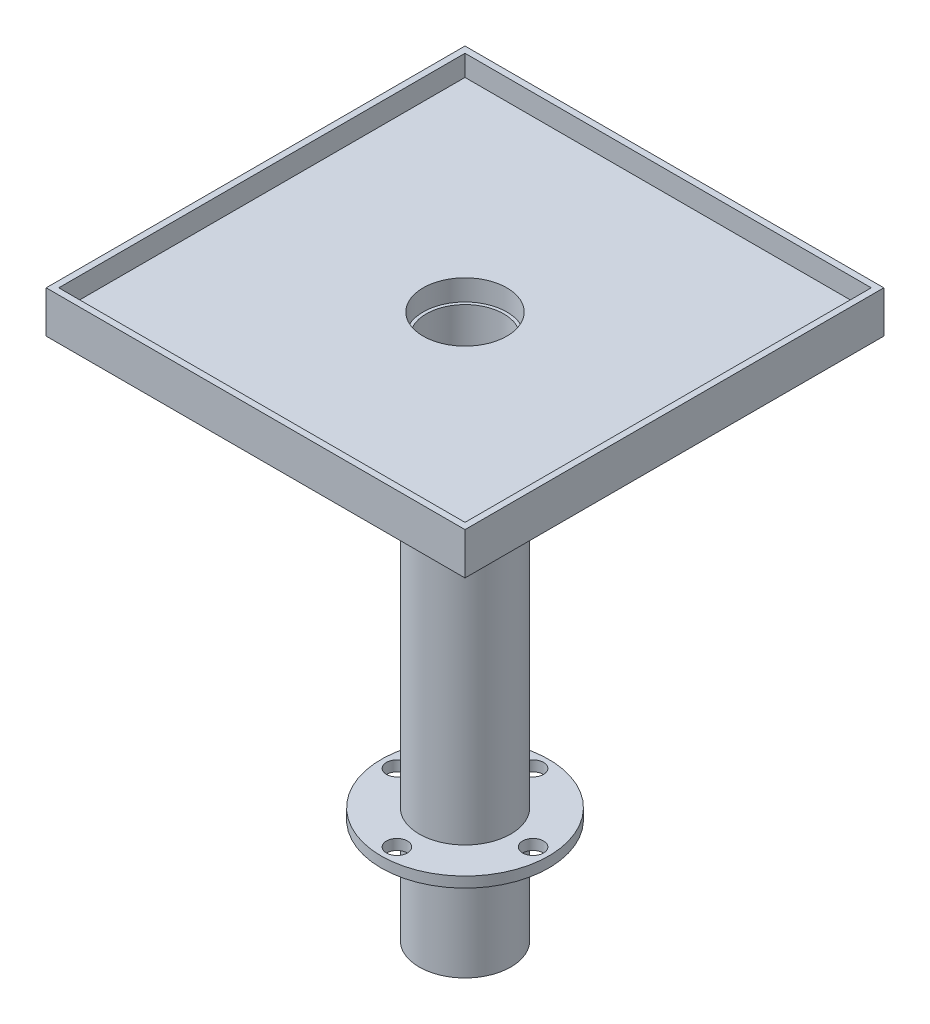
ISO-10303-21;
HEADER;
FILE_DESCRIPTION(('STEP AP214'),'2;1');
FILE_NAME('part.step','',(''),(''),'','','');
FILE_SCHEMA(('AUTOMOTIVE_DESIGN { 1 0 10303 214 1 1 1 1 }'));
ENDSEC;
DATA;
#1=APPLICATION_CONTEXT('core data for automotive mechanical design processes');
#2=APPLICATION_PROTOCOL_DEFINITION('international standard','automotive_design',2000,#1);
#3=PRODUCT_CONTEXT('',#1,'mechanical');
#4=PRODUCT('Part','Part','',(#3));
#5=PRODUCT_RELATED_PRODUCT_CATEGORY('part','',(#4));
#6=PRODUCT_DEFINITION_FORMATION('','',#4);
#7=PRODUCT_DEFINITION_CONTEXT('part definition',#1,'design');
#8=PRODUCT_DEFINITION('design','',#6,#7);
#9=PRODUCT_DEFINITION_SHAPE('','',#8);
#10=(LENGTH_UNIT() NAMED_UNIT(*) SI_UNIT(.MILLI.,.METRE.));
#11=(NAMED_UNIT(*) PLANE_ANGLE_UNIT() SI_UNIT($,.RADIAN.));
#12=(NAMED_UNIT(*) SI_UNIT($,.STERADIAN.) SOLID_ANGLE_UNIT());
#13=UNCERTAINTY_MEASURE_WITH_UNIT(LENGTH_MEASURE(1.E-05),#10,'distance_accuracy_value','');
#14=(GEOMETRIC_REPRESENTATION_CONTEXT(3) GLOBAL_UNCERTAINTY_ASSIGNED_CONTEXT((#13)) GLOBAL_UNIT_ASSIGNED_CONTEXT((#10,
#11,#12)) REPRESENTATION_CONTEXT('',''));
#15=CARTESIAN_POINT('',(0.,0.,0.));
#16=DIRECTION('',(0.,0.,1.));
#17=DIRECTION('',(1.,0.,0.));
#18=AXIS2_PLACEMENT_3D('',#15,#16,#17);
#19=CARTESIAN_POINT('',(0.,53.34,0.));
#20=DIRECTION('',(0.,1.,0.));
#21=DIRECTION('',(0.,0.,1.));
#22=AXIS2_PLACEMENT_3D('',#19,#20,#21);
#23=PLANE('',#22);
#24=CARTESIAN_POINT('',(0.,53.34,0.));
#25=DIRECTION('',(0.,1.,0.));
#26=DIRECTION('',(0.,0.,1.));
#27=AXIS2_PLACEMENT_3D('',#24,#25,#26);
#28=CIRCLE('',#27,5.08);
#29=CARTESIAN_POINT('',(0.,53.34,5.08));
#30=VERTEX_POINT('',#29);
#31=EDGE_CURVE('E195',#30,#30,#28,.T.);
#32=ORIENTED_EDGE('',*,*,#31,.F.);
#33=EDGE_LOOP('',(#32));
#34=FACE_BOUND('',#33,.T.);
#35=DIRECTION('',(0.,0.,1.));
#36=VECTOR('',#35,1.);
#37=CARTESIAN_POINT('',(24.638,53.34,0.));
#38=LINE('',#37,#36);
#39=CARTESIAN_POINT('',(24.638,53.34,-24.638));
#40=VERTEX_POINT('',#39);
#41=CARTESIAN_POINT('',(24.638,53.34,24.638));
#42=VERTEX_POINT('',#41);
#43=EDGE_CURVE('E65',#40,#42,#38,.T.);
#44=ORIENTED_EDGE('',*,*,#43,.F.);
#45=DIRECTION('',(1.,0.,0.));
#46=VECTOR('',#45,1.);
#47=CARTESIAN_POINT('',(0.,53.34,-24.638));
#48=LINE('',#47,#46);
#49=CARTESIAN_POINT('',(-24.638,53.34,-24.638));
#50=VERTEX_POINT('',#49);
#51=EDGE_CURVE('E173',#50,#40,#48,.T.);
#52=ORIENTED_EDGE('',*,*,#51,.F.);
#53=DIRECTION('',(0.,0.,1.));
#54=VECTOR('',#53,1.);
#55=CARTESIAN_POINT('',(-24.638,53.34,0.));
#56=LINE('',#55,#54);
#57=CARTESIAN_POINT('',(-24.638,53.34,24.638));
#58=VERTEX_POINT('',#57);
#59=EDGE_CURVE('E145',#50,#58,#56,.T.);
#60=ORIENTED_EDGE('',*,*,#59,.T.);
#61=DIRECTION('',(1.,0.,0.));
#62=VECTOR('',#61,1.);
#63=CARTESIAN_POINT('',(0.,53.34,24.638));
#64=LINE('',#63,#62);
#65=EDGE_CURVE('E70',#58,#42,#64,.T.);
#66=ORIENTED_EDGE('',*,*,#65,.T.);
#67=EDGE_LOOP('',(#44,#52,#60,#66));
#68=FACE_BOUND('',#67,.T.);
#69=ADVANCED_FACE('F47',(#34,#68),#23,.T.);
#70=CARTESIAN_POINT('',(0.,50.8,0.));
#71=DIRECTION('',(0.,1.,0.));
#72=DIRECTION('',(0.,0.,1.));
#73=AXIS2_PLACEMENT_3D('',#70,#71,#72);
#74=PLANE('',#73);
#75=CARTESIAN_POINT('',(0.,50.8,0.));
#76=DIRECTION('',(0.,1.,0.));
#77=DIRECTION('',(0.,0.,1.));
#78=AXIS2_PLACEMENT_3D('',#75,#76,#77);
#79=CIRCLE('',#78,4.699);
#80=CARTESIAN_POINT('',(0.,50.8,4.699));
#81=VERTEX_POINT('',#80);
#82=EDGE_CURVE('E221',#81,#81,#79,.T.);
#83=ORIENTED_EDGE('',*,*,#82,.F.);
#84=EDGE_LOOP('',(#83));
#85=FACE_BOUND('',#84,.T.);
#86=CARTESIAN_POINT('',(0.,50.8,0.));
#87=DIRECTION('',(0.,1.,0.));
#88=DIRECTION('',(0.,0.,1.));
#89=AXIS2_PLACEMENT_3D('',#86,#87,#88);
#90=CIRCLE('',#89,5.08);
#91=CARTESIAN_POINT('',(0.,50.8,5.08));
#92=VERTEX_POINT('',#91);
#93=EDGE_CURVE('E194',#92,#92,#90,.T.);
#94=ORIENTED_EDGE('',*,*,#93,.T.);
#95=EDGE_LOOP('',(#94));
#96=FACE_BOUND('',#95,.T.);
#97=ADVANCED_FACE('F280',(#85,#96),#74,.T.);
#98=CARTESIAN_POINT('',(0.,-12.7,0.));
#99=DIRECTION('',(0.,1.,0.));
#100=DIRECTION('',(0.,0.,1.));
#101=AXIS2_PLACEMENT_3D('',#98,#99,#100);
#102=CYLINDRICAL_SURFACE('',#101,5.55173289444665);
#103=CARTESIAN_POINT('',(0.,-12.7,0.));
#104=DIRECTION('',(0.,1.,0.));
#105=DIRECTION('',(0.,0.,1.));
#106=AXIS2_PLACEMENT_3D('',#103,#104,#105);
#107=CIRCLE('',#106,5.55173289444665);
#108=CARTESIAN_POINT('',(0.,-12.7,5.55173289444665));
#109=VERTEX_POINT('',#108);
#110=EDGE_CURVE('E233',#109,#109,#107,.T.);
#111=ORIENTED_EDGE('',*,*,#110,.T.);
#112=EDGE_LOOP('',(#111));
#113=FACE_BOUND('',#112,.T.);
#114=CARTESIAN_POINT('',(0.,0.,0.));
#115=DIRECTION('',(0.,1.,0.));
#116=DIRECTION('',(0.,0.,1.));
#117=AXIS2_PLACEMENT_3D('',#114,#115,#116);
#118=CIRCLE('',#117,5.55173289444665);
#119=CARTESIAN_POINT('',(0.,0.,5.55173289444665));
#120=VERTEX_POINT('',#119);
#121=EDGE_CURVE('E236',#120,#120,#118,.T.);
#122=ORIENTED_EDGE('',*,*,#121,.F.);
#123=EDGE_LOOP('',(#122));
#124=FACE_BOUND('',#123,.T.);
#125=ADVANCED_FACE('F288',(#113,#124),#102,.T.);
#126=CARTESIAN_POINT('',(0.,1.27,0.));
#127=DIRECTION('',(0.,1.,0.));
#128=DIRECTION('',(0.,0.,1.));
#129=AXIS2_PLACEMENT_3D('',#126,#127,#128);
#130=CIRCLE('',#129,5.55173289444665);
#131=CARTESIAN_POINT('',(0.,1.27,5.55173289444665));
#132=VERTEX_POINT('',#131);
#133=EDGE_CURVE('E11',#132,#132,#130,.T.);
#134=ORIENTED_EDGE('',*,*,#133,.T.);
#135=EDGE_LOOP('',(#134));
#136=FACE_BOUND('',#135,.T.);
#137=CARTESIAN_POINT('',(0.,50.8,0.));
#138=DIRECTION('',(0.,1.,0.));
#139=DIRECTION('',(0.,0.,1.));
#140=AXIS2_PLACEMENT_3D('',#137,#138,#139);
#141=CIRCLE('',#140,5.55173289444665);
#142=CARTESIAN_POINT('',(0.,50.8,5.55173289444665));
#143=VERTEX_POINT('',#142);
#144=EDGE_CURVE('E225',#143,#143,#141,.T.);
#145=ORIENTED_EDGE('',*,*,#144,.F.);
#146=EDGE_LOOP('',(#145));
#147=FACE_BOUND('',#146,.T.);
#148=ADVANCED_FACE('F319',(#136,#147),#102,.T.);
#149=CARTESIAN_POINT('',(0.,-12.7,0.));
#150=DIRECTION('',(0.,1.,0.));
#151=DIRECTION('',(0.,0.,1.));
#152=AXIS2_PLACEMENT_3D('',#149,#150,#151);
#153=PLANE('',#152);
#154=CARTESIAN_POINT('',(0.,-12.7,0.));
#155=DIRECTION('',(0.,1.,0.));
#156=DIRECTION('',(0.,0.,1.));
#157=AXIS2_PLACEMENT_3D('',#154,#155,#156);
#158=CIRCLE('',#157,4.699);
#159=CARTESIAN_POINT('',(0.,-12.7,4.699));
#160=VERTEX_POINT('',#159);
#161=EDGE_CURVE('E229',#160,#160,#158,.T.);
#162=ORIENTED_EDGE('',*,*,#161,.T.);
#163=EDGE_LOOP('',(#162));
#164=FACE_BOUND('',#163,.T.);
#165=ORIENTED_EDGE('',*,*,#110,.F.);
#166=EDGE_LOOP('',(#165));
#167=FACE_BOUND('',#166,.T.);
#168=ADVANCED_FACE('F315',(#164,#167),#153,.F.);
#169=CARTESIAN_POINT('',(0.,-12.7,0.));
#170=DIRECTION('',(0.,1.,0.));
#171=DIRECTION('',(0.,0.,1.));
#172=AXIS2_PLACEMENT_3D('',#169,#170,#171);
#173=CYLINDRICAL_SURFACE('',#172,4.699);
#174=ORIENTED_EDGE('',*,*,#161,.F.);
#175=EDGE_LOOP('',(#174));
#176=FACE_BOUND('',#175,.T.);
#177=ORIENTED_EDGE('',*,*,#82,.T.);
#178=EDGE_LOOP('',(#177));
#179=FACE_BOUND('',#178,.T.);
#180=ADVANCED_FACE('F311',(#176,#179),#173,.F.);
#181=CARTESIAN_POINT('',(0.,1.27,0.));
#182=DIRECTION('',(0.,1.,0.));
#183=DIRECTION('',(0.,0.,1.));
#184=AXIS2_PLACEMENT_3D('',#181,#182,#183);
#185=PLANE('',#184);
#186=CARTESIAN_POINT('',(0.,1.27,-8.255));
#187=DIRECTION('',(0.,1.,0.));
#188=DIRECTION('',(0.,0.,1.));
#189=AXIS2_PLACEMENT_3D('',#186,#187,#188);
#190=CIRCLE('',#189,1.27);
#191=CARTESIAN_POINT('',(0.,1.27,-6.985));
#192=VERTEX_POINT('',#191);
#193=EDGE_CURVE('E253',#192,#192,#190,.T.);
#194=ORIENTED_EDGE('',*,*,#193,.F.);
#195=EDGE_LOOP('',(#194));
#196=FACE_BOUND('',#195,.T.);
#197=CARTESIAN_POINT('',(0.,1.27,8.255));
#198=DIRECTION('',(0.,1.,0.));
#199=DIRECTION('',(0.,0.,1.));
#200=AXIS2_PLACEMENT_3D('',#197,#198,#199);
#201=CIRCLE('',#200,1.27);
#202=CARTESIAN_POINT('',(0.,1.27,9.525));
#203=VERTEX_POINT('',#202);
#204=EDGE_CURVE('E517',#203,#203,#201,.T.);
#205=ORIENTED_EDGE('',*,*,#204,.F.);
#206=EDGE_LOOP('',(#205));
#207=FACE_BOUND('',#206,.T.);
#208=CARTESIAN_POINT('',(8.255,1.27,0.));
#209=DIRECTION('',(0.,1.,0.));
#210=DIRECTION('',(0.,0.,1.));
#211=AXIS2_PLACEMENT_3D('',#208,#209,#210);
#212=CIRCLE('',#211,1.27);
#213=CARTESIAN_POINT('',(8.255,1.27,1.27));
#214=VERTEX_POINT('',#213);
#215=EDGE_CURVE('E506',#214,#214,#212,.T.);
#216=ORIENTED_EDGE('',*,*,#215,.F.);
#217=EDGE_LOOP('',(#216));
#218=FACE_BOUND('',#217,.T.);
#219=CARTESIAN_POINT('',(-8.255,1.27,0.));
#220=DIRECTION('',(0.,1.,0.));
#221=DIRECTION('',(0.,0.,1.));
#222=AXIS2_PLACEMENT_3D('',#219,#220,#221);
#223=CIRCLE('',#222,1.27);
#224=CARTESIAN_POINT('',(-8.255,1.27,1.27));
#225=VERTEX_POINT('',#224);
#226=EDGE_CURVE('E150',#225,#225,#223,.T.);
#227=ORIENTED_EDGE('',*,*,#226,.F.);
#228=EDGE_LOOP('',(#227));
#229=FACE_BOUND('',#228,.T.);
#230=ORIENTED_EDGE('',*,*,#133,.F.);
#231=EDGE_LOOP('',(#230));
#232=FACE_BOUND('',#231,.T.);
#233=CARTESIAN_POINT('',(0.,1.27,0.));
#234=DIRECTION('',(0.,1.,0.));
#235=DIRECTION('',(0.,0.,1.));
#236=AXIS2_PLACEMENT_3D('',#233,#234,#235);
#237=CIRCLE('',#236,10.16);
#238=CARTESIAN_POINT('',(0.,1.27,10.16));
#239=VERTEX_POINT('',#238);
#240=EDGE_CURVE('E57',#239,#239,#237,.T.);
#241=ORIENTED_EDGE('',*,*,#240,.T.);
#242=EDGE_LOOP('',(#241));
#243=FACE_BOUND('',#242,.T.);
#244=ADVANCED_FACE('F314',(#196,#207,#218,#229,#232,#243),#185,.T.);
#245=CARTESIAN_POINT('',(0.,0.,0.));
#246=DIRECTION('',(0.,1.,0.));
#247=DIRECTION('',(0.,0.,1.));
#248=AXIS2_PLACEMENT_3D('',#245,#246,#247);
#249=PLANE('',#248);
#250=CARTESIAN_POINT('',(0.,0.,-8.255));
#251=DIRECTION('',(0.,1.,0.));
#252=DIRECTION('',(0.,0.,1.));
#253=AXIS2_PLACEMENT_3D('',#250,#251,#252);
#254=CIRCLE('',#253,1.27);
#255=CARTESIAN_POINT('',(0.,0.,-6.985));
#256=VERTEX_POINT('',#255);
#257=EDGE_CURVE('E51',#256,#256,#254,.T.);
#258=ORIENTED_EDGE('',*,*,#257,.T.);
#259=EDGE_LOOP('',(#258));
#260=FACE_BOUND('',#259,.T.);
#261=CARTESIAN_POINT('',(0.,0.,8.255));
#262=DIRECTION('',(0.,1.,0.));
#263=DIRECTION('',(0.,0.,1.));
#264=AXIS2_PLACEMENT_3D('',#261,#262,#263);
#265=CIRCLE('',#264,1.27);
#266=CARTESIAN_POINT('',(0.,0.,9.525));
#267=VERTEX_POINT('',#266);
#268=EDGE_CURVE('E256',#267,#267,#265,.T.);
#269=ORIENTED_EDGE('',*,*,#268,.T.);
#270=EDGE_LOOP('',(#269));
#271=FACE_BOUND('',#270,.T.);
#272=CARTESIAN_POINT('',(8.255,0.,0.));
#273=DIRECTION('',(0.,1.,0.));
#274=DIRECTION('',(0.,0.,1.));
#275=AXIS2_PLACEMENT_3D('',#272,#273,#274);
#276=CIRCLE('',#275,1.27);
#277=CARTESIAN_POINT('',(8.255,0.,1.27));
#278=VERTEX_POINT('',#277);
#279=EDGE_CURVE('E252',#278,#278,#276,.T.);
#280=ORIENTED_EDGE('',*,*,#279,.T.);
#281=EDGE_LOOP('',(#280));
#282=FACE_BOUND('',#281,.T.);
#283=CARTESIAN_POINT('',(-8.255,0.,0.));
#284=DIRECTION('',(0.,1.,0.));
#285=DIRECTION('',(0.,0.,1.));
#286=AXIS2_PLACEMENT_3D('',#283,#284,#285);
#287=CIRCLE('',#286,1.27);
#288=CARTESIAN_POINT('',(-8.255,0.,1.27));
#289=VERTEX_POINT('',#288);
#290=EDGE_CURVE('E248',#289,#289,#287,.T.);
#291=ORIENTED_EDGE('',*,*,#290,.T.);
#292=EDGE_LOOP('',(#291));
#293=FACE_BOUND('',#292,.T.);
#294=ORIENTED_EDGE('',*,*,#121,.T.);
#295=EDGE_LOOP('',(#294));
#296=FACE_BOUND('',#295,.T.);
#297=CARTESIAN_POINT('',(0.,0.,0.));
#298=DIRECTION('',(0.,1.,0.));
#299=DIRECTION('',(0.,0.,1.));
#300=AXIS2_PLACEMENT_3D('',#297,#298,#299);
#301=CIRCLE('',#300,10.16);
#302=CARTESIAN_POINT('',(0.,0.,10.16));
#303=VERTEX_POINT('',#302);
#304=EDGE_CURVE('E241',#303,#303,#301,.T.);
#305=ORIENTED_EDGE('',*,*,#304,.F.);
#306=EDGE_LOOP('',(#305));
#307=FACE_BOUND('',#306,.T.);
#308=ADVANCED_FACE('F265',(#260,#271,#282,#293,#296,#307),#249,.F.);
#309=CARTESIAN_POINT('',(0.,1.27,0.));
#310=DIRECTION('',(0.,-1.,0.));
#311=DIRECTION('',(0.,0.,-1.));
#312=AXIS2_PLACEMENT_3D('',#309,#310,#311);
#313=CYLINDRICAL_SURFACE('',#312,10.16);
#314=ORIENTED_EDGE('',*,*,#240,.F.);
#315=EDGE_LOOP('',(#314));
#316=FACE_BOUND('',#315,.T.);
#317=ORIENTED_EDGE('',*,*,#304,.T.);
#318=EDGE_LOOP('',(#317));
#319=FACE_BOUND('',#318,.T.);
#320=ADVANCED_FACE('F49',(#316,#319),#313,.T.);
#321=CARTESIAN_POINT('',(0.,50.8,0.));
#322=DIRECTION('',(0.,1.,0.));
#323=DIRECTION('',(0.,0.,1.));
#324=AXIS2_PLACEMENT_3D('',#321,#322,#323);
#325=PLANE('',#324);
#326=DIRECTION('',(0.,0.,1.));
#327=VECTOR('',#326,1.);
#328=CARTESIAN_POINT('',(-25.4,50.8,-25.4));
#329=LINE('',#328,#327);
#330=CARTESIAN_POINT('',(-25.4,50.8,-25.4));
#331=VERTEX_POINT('',#330);
#332=CARTESIAN_POINT('',(-25.4,50.8,25.4));
#333=VERTEX_POINT('',#332);
#334=EDGE_CURVE('E199',#331,#333,#329,.T.);
#335=ORIENTED_EDGE('',*,*,#334,.F.);
#336=DIRECTION('',(-1.,0.,0.));
#337=VECTOR('',#336,1.);
#338=CARTESIAN_POINT('',(-25.4,50.8,-25.4));
#339=LINE('',#338,#337);
#340=CARTESIAN_POINT('',(25.4,50.8,-25.4));
#341=VERTEX_POINT('',#340);
#342=EDGE_CURVE('E121',#341,#331,#339,.T.);
#343=ORIENTED_EDGE('',*,*,#342,.F.);
#344=DIRECTION('',(0.,0.,-1.));
#345=VECTOR('',#344,1.);
#346=CARTESIAN_POINT('',(25.4,50.8,-25.4));
#347=LINE('',#346,#345);
#348=CARTESIAN_POINT('',(25.4,50.8,25.4));
#349=VERTEX_POINT('',#348);
#350=EDGE_CURVE('E208',#349,#341,#347,.T.);
#351=ORIENTED_EDGE('',*,*,#350,.F.);
#352=DIRECTION('',(1.,0.,0.));
#353=VECTOR('',#352,1.);
#354=CARTESIAN_POINT('',(-25.4,50.8,25.4));
#355=LINE('',#354,#353);
#356=EDGE_CURVE('E205',#333,#349,#355,.T.);
#357=ORIENTED_EDGE('',*,*,#356,.F.);
#358=EDGE_LOOP('',(#335,#343,#351,#357));
#359=FACE_BOUND('',#358,.T.);
#360=ORIENTED_EDGE('',*,*,#144,.T.);
#361=EDGE_LOOP('',(#360));
#362=FACE_BOUND('',#361,.T.);
#363=ADVANCED_FACE('F296',(#359,#362),#325,.F.);
#364=CARTESIAN_POINT('',(-25.4,53.34,-25.4));
#365=DIRECTION('',(1.,0.,0.));
#366=DIRECTION('',(0.,0.,-1.));
#367=AXIS2_PLACEMENT_3D('',#364,#365,#366);
#368=PLANE('',#367);
#369=ORIENTED_EDGE('',*,*,#334,.T.);
#370=DIRECTION('',(0.,-1.,0.));
#371=VECTOR('',#370,1.);
#372=CARTESIAN_POINT('',(-25.4,53.34,25.4));
#373=LINE('',#372,#371);
#374=CARTESIAN_POINT('',(-25.4,55.88,25.4));
#375=VERTEX_POINT('',#374);
#376=EDGE_CURVE('E132',#375,#333,#373,.T.);
#377=ORIENTED_EDGE('',*,*,#376,.F.);
#378=DIRECTION('',(0.,0.,1.));
#379=VECTOR('',#378,1.);
#380=CARTESIAN_POINT('',(-25.4,55.88,0.));
#381=LINE('',#380,#379);
#382=CARTESIAN_POINT('',(-25.4,55.88,-25.4));
#383=VERTEX_POINT('',#382);
#384=EDGE_CURVE('E129',#383,#375,#381,.T.);
#385=ORIENTED_EDGE('',*,*,#384,.F.);
#386=DIRECTION('',(0.,-1.,0.));
#387=VECTOR('',#386,1.);
#388=CARTESIAN_POINT('',(-25.4,53.34,-25.4));
#389=LINE('',#388,#387);
#390=EDGE_CURVE('E114',#383,#331,#389,.T.);
#391=ORIENTED_EDGE('',*,*,#390,.T.);
#392=EDGE_LOOP('',(#369,#377,#385,#391));
#393=FACE_BOUND('',#392,.T.);
#394=ADVANCED_FACE('F130',(#393),#368,.F.);
#395=CARTESIAN_POINT('',(-25.4,53.34,25.4));
#396=DIRECTION('',(0.,0.,-1.));
#397=DIRECTION('',(-1.,0.,0.));
#398=AXIS2_PLACEMENT_3D('',#395,#396,#397);
#399=PLANE('',#398);
#400=ORIENTED_EDGE('',*,*,#356,.T.);
#401=DIRECTION('',(0.,-1.,0.));
#402=VECTOR('',#401,1.);
#403=CARTESIAN_POINT('',(25.4,53.34,25.4));
#404=LINE('',#403,#402);
#405=CARTESIAN_POINT('',(25.4,55.88,25.4));
#406=VERTEX_POINT('',#405);
#407=EDGE_CURVE('E215',#406,#349,#404,.T.);
#408=ORIENTED_EDGE('',*,*,#407,.F.);
#409=DIRECTION('',(1.,0.,0.));
#410=VECTOR('',#409,1.);
#411=CARTESIAN_POINT('',(0.,55.88,25.4));
#412=LINE('',#411,#410);
#413=EDGE_CURVE('E137',#375,#406,#412,.T.);
#414=ORIENTED_EDGE('',*,*,#413,.F.);
#415=ORIENTED_EDGE('',*,*,#376,.T.);
#416=EDGE_LOOP('',(#400,#408,#414,#415));
#417=FACE_BOUND('',#416,.T.);
#418=ADVANCED_FACE('F305',(#417),#399,.F.);
#419=CARTESIAN_POINT('',(25.4,53.34,-25.4));
#420=DIRECTION('',(-1.,0.,0.));
#421=DIRECTION('',(0.,0.,1.));
#422=AXIS2_PLACEMENT_3D('',#419,#420,#421);
#423=PLANE('',#422);
#424=ORIENTED_EDGE('',*,*,#350,.T.);
#425=DIRECTION('',(0.,-1.,0.));
#426=VECTOR('',#425,1.);
#427=CARTESIAN_POINT('',(25.4,53.34,-25.4));
#428=LINE('',#427,#426);
#429=CARTESIAN_POINT('',(25.4,55.88,-25.4));
#430=VERTEX_POINT('',#429);
#431=EDGE_CURVE('E126',#430,#341,#428,.T.);
#432=ORIENTED_EDGE('',*,*,#431,.F.);
#433=DIRECTION('',(0.,0.,-1.));
#434=VECTOR('',#433,1.);
#435=CARTESIAN_POINT('',(25.4,55.88,0.));
#436=LINE('',#435,#434);
#437=EDGE_CURVE('E143',#406,#430,#436,.T.);
#438=ORIENTED_EDGE('',*,*,#437,.F.);
#439=ORIENTED_EDGE('',*,*,#407,.T.);
#440=EDGE_LOOP('',(#424,#432,#438,#439));
#441=FACE_BOUND('',#440,.T.);
#442=ADVANCED_FACE('F302',(#441),#423,.F.);
#443=CARTESIAN_POINT('',(-25.4,53.34,-25.4));
#444=DIRECTION('',(0.,0.,1.));
#445=DIRECTION('',(1.,0.,0.));
#446=AXIS2_PLACEMENT_3D('',#443,#444,#445);
#447=PLANE('',#446);
#448=ORIENTED_EDGE('',*,*,#342,.T.);
#449=ORIENTED_EDGE('',*,*,#390,.F.);
#450=DIRECTION('',(-1.,0.,0.));
#451=VECTOR('',#450,1.);
#452=CARTESIAN_POINT('',(0.,55.88,-25.4));
#453=LINE('',#452,#451);
#454=EDGE_CURVE('E119',#430,#383,#453,.T.);
#455=ORIENTED_EDGE('',*,*,#454,.F.);
#456=ORIENTED_EDGE('',*,*,#431,.T.);
#457=EDGE_LOOP('',(#448,#449,#455,#456));
#458=FACE_BOUND('',#457,.T.);
#459=ADVANCED_FACE('F116',(#458),#447,.F.);
#460=CARTESIAN_POINT('',(0.,53.34,0.));
#461=DIRECTION('',(0.,-1.,0.));
#462=DIRECTION('',(0.,0.,-1.));
#463=AXIS2_PLACEMENT_3D('',#460,#461,#462);
#464=CYLINDRICAL_SURFACE('',#463,5.08);
#465=ORIENTED_EDGE('',*,*,#31,.T.);
#466=EDGE_LOOP('',(#465));
#467=FACE_BOUND('',#466,.T.);
#468=ORIENTED_EDGE('',*,*,#93,.F.);
#469=EDGE_LOOP('',(#468));
#470=FACE_BOUND('',#469,.T.);
#471=ADVANCED_FACE('F294',(#467,#470),#464,.F.);
#472=CARTESIAN_POINT('',(0.,55.88,-24.638));
#473=DIRECTION('',(0.,0.,-1.));
#474=DIRECTION('',(-1.,0.,0.));
#475=AXIS2_PLACEMENT_3D('',#472,#473,#474);
#476=PLANE('',#475);
#477=ORIENTED_EDGE('',*,*,#51,.T.);
#478=DIRECTION('',(0.,-1.,0.));
#479=VECTOR('',#478,1.);
#480=CARTESIAN_POINT('',(24.638,55.88,-24.638));
#481=LINE('',#480,#479);
#482=CARTESIAN_POINT('',(24.638,55.88,-24.638));
#483=VERTEX_POINT('',#482);
#484=EDGE_CURVE('E191',#483,#40,#481,.T.);
#485=ORIENTED_EDGE('',*,*,#484,.F.);
#486=DIRECTION('',(1.,0.,0.));
#487=VECTOR('',#486,1.);
#488=CARTESIAN_POINT('',(0.,55.88,-24.638));
#489=LINE('',#488,#487);
#490=CARTESIAN_POINT('',(-24.638,55.88,-24.638));
#491=VERTEX_POINT('',#490);
#492=EDGE_CURVE('E157',#491,#483,#489,.T.);
#493=ORIENTED_EDGE('',*,*,#492,.F.);
#494=DIRECTION('',(0.,-1.,0.));
#495=VECTOR('',#494,1.);
#496=CARTESIAN_POINT('',(-24.638,55.88,-24.638));
#497=LINE('',#496,#495);
#498=EDGE_CURVE('E172',#491,#50,#497,.T.);
#499=ORIENTED_EDGE('',*,*,#498,.T.);
#500=EDGE_LOOP('',(#477,#485,#493,#499));
#501=FACE_BOUND('',#500,.T.);
#502=ADVANCED_FACE('F376',(#501),#476,.F.);
#503=CARTESIAN_POINT('',(24.638,55.88,0.));
#504=DIRECTION('',(1.,0.,0.));
#505=DIRECTION('',(0.,0.,-1.));
#506=AXIS2_PLACEMENT_3D('',#503,#504,#505);
#507=PLANE('',#506);
#508=ORIENTED_EDGE('',*,*,#43,.T.);
#509=DIRECTION('',(0.,-1.,0.));
#510=VECTOR('',#509,1.);
#511=CARTESIAN_POINT('',(24.638,55.88,24.638));
#512=LINE('',#511,#510);
#513=CARTESIAN_POINT('',(24.638,55.88,24.638));
#514=VERTEX_POINT('',#513);
#515=EDGE_CURVE('E188',#514,#42,#512,.T.);
#516=ORIENTED_EDGE('',*,*,#515,.F.);
#517=DIRECTION('',(0.,0.,1.));
#518=VECTOR('',#517,1.);
#519=CARTESIAN_POINT('',(24.638,55.88,0.));
#520=LINE('',#519,#518);
#521=EDGE_CURVE('E161',#483,#514,#520,.T.);
#522=ORIENTED_EDGE('',*,*,#521,.F.);
#523=ORIENTED_EDGE('',*,*,#484,.T.);
#524=EDGE_LOOP('',(#508,#516,#522,#523));
#525=FACE_BOUND('',#524,.T.);
#526=ADVANCED_FACE('F435',(#525),#507,.F.);
#527=CARTESIAN_POINT('',(0.,55.88,24.638));
#528=DIRECTION('',(0.,0.,-1.));
#529=DIRECTION('',(-1.,0.,0.));
#530=AXIS2_PLACEMENT_3D('',#527,#528,#529);
#531=PLANE('',#530);
#532=ORIENTED_EDGE('',*,*,#65,.F.);
#533=DIRECTION('',(0.,-1.,0.));
#534=VECTOR('',#533,1.);
#535=CARTESIAN_POINT('',(-24.638,55.88,24.638));
#536=LINE('',#535,#534);
#537=CARTESIAN_POINT('',(-24.638,55.88,24.638));
#538=VERTEX_POINT('',#537);
#539=EDGE_CURVE('E184',#538,#58,#536,.T.);
#540=ORIENTED_EDGE('',*,*,#539,.F.);
#541=DIRECTION('',(1.,0.,0.));
#542=VECTOR('',#541,1.);
#543=CARTESIAN_POINT('',(0.,55.88,24.638));
#544=LINE('',#543,#542);
#545=EDGE_CURVE('E164',#538,#514,#544,.T.);
#546=ORIENTED_EDGE('',*,*,#545,.T.);
#547=ORIENTED_EDGE('',*,*,#515,.T.);
#548=EDGE_LOOP('',(#532,#540,#546,#547));
#549=FACE_BOUND('',#548,.T.);
#550=ADVANCED_FACE('F444',(#549),#531,.T.);
#551=CARTESIAN_POINT('',(-24.638,55.88,0.));
#552=DIRECTION('',(1.,0.,0.));
#553=DIRECTION('',(0.,0.,-1.));
#554=AXIS2_PLACEMENT_3D('',#551,#552,#553);
#555=PLANE('',#554);
#556=ORIENTED_EDGE('',*,*,#59,.F.);
#557=ORIENTED_EDGE('',*,*,#498,.F.);
#558=DIRECTION('',(0.,0.,1.));
#559=VECTOR('',#558,1.);
#560=CARTESIAN_POINT('',(-24.638,55.88,0.));
#561=LINE('',#560,#559);
#562=EDGE_CURVE('E168',#491,#538,#561,.T.);
#563=ORIENTED_EDGE('',*,*,#562,.T.);
#564=ORIENTED_EDGE('',*,*,#539,.T.);
#565=EDGE_LOOP('',(#556,#557,#563,#564));
#566=FACE_BOUND('',#565,.T.);
#567=ADVANCED_FACE('F454',(#566),#555,.T.);
#568=CARTESIAN_POINT('',(0.,55.88,0.));
#569=DIRECTION('',(0.,1.,0.));
#570=DIRECTION('',(0.,0.,1.));
#571=AXIS2_PLACEMENT_3D('',#568,#569,#570);
#572=PLANE('',#571);
#573=ORIENTED_EDGE('',*,*,#454,.T.);
#574=ORIENTED_EDGE('',*,*,#384,.T.);
#575=ORIENTED_EDGE('',*,*,#413,.T.);
#576=ORIENTED_EDGE('',*,*,#437,.T.);
#577=EDGE_LOOP('',(#573,#574,#575,#576));
#578=FACE_BOUND('',#577,.T.);
#579=ORIENTED_EDGE('',*,*,#492,.T.);
#580=ORIENTED_EDGE('',*,*,#521,.T.);
#581=ORIENTED_EDGE('',*,*,#545,.F.);
#582=ORIENTED_EDGE('',*,*,#562,.F.);
#583=EDGE_LOOP('',(#579,#580,#581,#582));
#584=FACE_BOUND('',#583,.T.);
#585=ADVANCED_FACE('F140',(#578,#584),#572,.T.);
#586=CARTESIAN_POINT('',(-8.255,-12.7,0.));
#587=DIRECTION('',(0.,1.,0.));
#588=DIRECTION('',(0.,0.,1.));
#589=AXIS2_PLACEMENT_3D('',#586,#587,#588);
#590=CYLINDRICAL_SURFACE('',#589,1.27);
#591=ORIENTED_EDGE('',*,*,#226,.T.);
#592=EDGE_LOOP('',(#591));
#593=FACE_BOUND('',#592,.T.);
#594=ORIENTED_EDGE('',*,*,#290,.F.);
#595=EDGE_LOOP('',(#594));
#596=FACE_BOUND('',#595,.T.);
#597=ADVANCED_FACE('F473',(#593,#596),#590,.F.);
#598=CARTESIAN_POINT('',(8.255,-12.7,0.));
#599=DIRECTION('',(0.,1.,0.));
#600=DIRECTION('',(0.,0.,1.));
#601=AXIS2_PLACEMENT_3D('',#598,#599,#600);
#602=CYLINDRICAL_SURFACE('',#601,1.27);
#603=ORIENTED_EDGE('',*,*,#215,.T.);
#604=EDGE_LOOP('',(#603));
#605=FACE_BOUND('',#604,.T.);
#606=ORIENTED_EDGE('',*,*,#279,.F.);
#607=EDGE_LOOP('',(#606));
#608=FACE_BOUND('',#607,.T.);
#609=ADVANCED_FACE('F275',(#605,#608),#602,.F.);
#610=CARTESIAN_POINT('',(0.,-12.7,8.255));
#611=DIRECTION('',(0.,1.,0.));
#612=DIRECTION('',(0.,0.,1.));
#613=AXIS2_PLACEMENT_3D('',#610,#611,#612);
#614=CYLINDRICAL_SURFACE('',#613,1.27);
#615=ORIENTED_EDGE('',*,*,#204,.T.);
#616=EDGE_LOOP('',(#615));
#617=FACE_BOUND('',#616,.T.);
#618=ORIENTED_EDGE('',*,*,#268,.F.);
#619=EDGE_LOOP('',(#618));
#620=FACE_BOUND('',#619,.T.);
#621=ADVANCED_FACE('F269',(#617,#620),#614,.F.);
#622=CARTESIAN_POINT('',(0.,-12.7,-8.255));
#623=DIRECTION('',(0.,1.,0.));
#624=DIRECTION('',(0.,0.,1.));
#625=AXIS2_PLACEMENT_3D('',#622,#623,#624);
#626=CYLINDRICAL_SURFACE('',#625,1.27);
#627=ORIENTED_EDGE('',*,*,#193,.T.);
#628=EDGE_LOOP('',(#627));
#629=FACE_BOUND('',#628,.T.);
#630=ORIENTED_EDGE('',*,*,#257,.F.);
#631=EDGE_LOOP('',(#630));
#632=FACE_BOUND('',#631,.T.);
#633=ADVANCED_FACE('F267',(#629,#632),#626,.F.);
#634=CLOSED_SHELL('',(#69,#97,#125,#148,#168,#180,#244,#308,#320,#363,#394,#418,#442,#459,#471,
#502,#526,#550,#567,#585,#597,#609,#621,#633));
#635=MANIFOLD_SOLID_BREP('B2',#634);
#636=ADVANCED_BREP_SHAPE_REPRESENTATION('',(#18,#635),#14);
#637=SHAPE_DEFINITION_REPRESENTATION(#9,#636);
ENDSEC;
END-ISO-10303-21;
